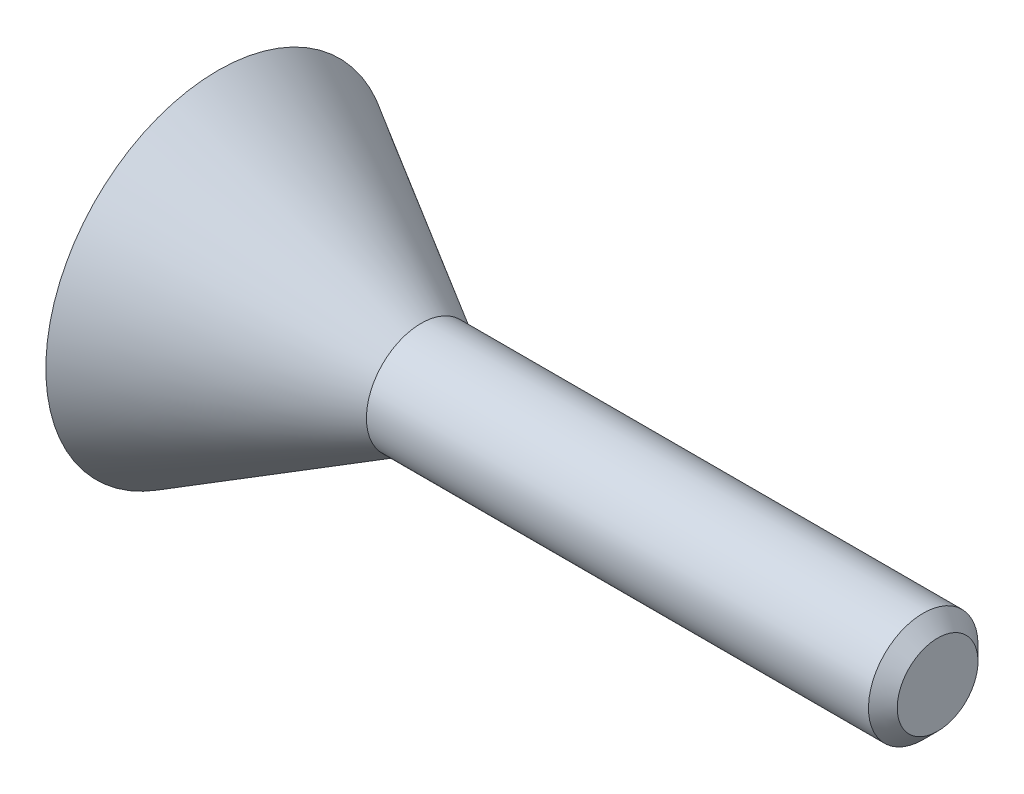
from build123d import *

# Parameters (mm, degrees)
SKETCH1_R           = 5.5
BOSS_EXTRUDE1_DEPTH = 11.5
CUT_EXTRUDE1_DEPTH  = 0.6
CHAMFER1_SIZE       = 0.46
CUT_EXTRUDE2_DEPTH  = 0.6


with BuildPart() as part:
    # Sketch1 → Boss-Extrude1 (new, symmetric)
    with BuildSketch(Plane(origin=(0, 0, 0), x_dir=(0, 0, -1), z_dir=(1, 0, 0))):
        Circle(SKETCH1_R)
    extrude(amount=BOSS_EXTRUDE1_DEPTH, both=True)

    # Sketch2 → Cut-Revolve1 (revolve, cut)
    with BuildSketch(Plane.XY, mode=Mode.PRIVATE) as cut_revolve1_sk:
        Polygon((-5.004809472, 1.75), (11.5, 1.75), (11.5, 5.5), (-11.5, 5.5), align=None)
    revolve(cut_revolve1_sk.sketch.rotate(Axis((-11.5, 0, 0), (1, 0, 0)), 180), axis=Axis((-11.5, 0, 0), (1, 0, 0)), mode=Mode.SUBTRACT)

    # Sketch3 → Cut-Extrude1 (cut)
    with BuildSketch(Plane.ZY.offset(11.5)):
        with BuildLine():
            Line((0.42, 3.15), (0.42, -4.07))
            ThreePointArc((0.42, -4.07), (0, -4.49), (-0.42, -4.07))
            Line((-0.42, -4.07), (-0.42, 3.15))
            Line((-0.42, 3.15), (-1.01, 3.15))
            Line((-1.01, 3.15), (0, 4.83))
            Line((0, 4.83), (1.01, 3.15))
            Line((1.01, 3.15), (0.42, 3.15))
        make_face()
    extrude(amount=-CUT_EXTRUDE1_DEPTH, mode=Mode.SUBTRACT)

    # Chamfer1
    chamfer1_edges = [part.edges().sort_by_distance(p)[0] for p in [
        (11.5, 1.75, 0),
    ]]
    chamfer(chamfer1_edges, length=CHAMFER1_SIZE)

    # Sketch4 → Cut-Extrude2 (cut)
    with BuildSketch(Plane.ZY.offset(11.5)):
        with BuildLine():
            Line((3.410725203, -1.922656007), (3.410725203, -1.242461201))
            Line((3.410725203, -1.242461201), (2.043842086, 0.568415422))
            add(Edge.make_bspline(
                [(2.043842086, 0.568415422), (2.015212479, 0.608756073), (1.959428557, 0.687358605), (1.90893981, 0.795303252), (1.877487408, 0.879933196), (1.862497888, 0.94130661), (1.85180483, 0.999862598), (1.850488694, 1.03833865), (1.84984858, 1.057051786)],
                knots=[0, 0, 0, 0, 1.664252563, 3.24274559, 3.998498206, 4.704056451, 5.369707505, 6, 6, 6, 6], degree=3))
            Line((1.84984858, 1.057051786), (1.84984858, 1.062733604))
            add(Edge.make_bspline(
                [(1.84984858, 1.062733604), (1.850957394, 1.088309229), (1.853081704, 1.137308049), (1.873096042, 1.206348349), (1.905898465, 1.266471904), (1.952879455, 1.316133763), (2.011367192, 1.355413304), (2.081349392, 1.383095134), (2.161910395, 1.398968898), (2.219092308, 1.400967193), (2.249199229, 1.402019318)],
                knots=[0, 0, 0, 0, 1.029992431, 1.973301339, 2.872554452, 3.768620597, 4.704316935, 5.693697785, 6.785705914, 8, 8, 8, 8], degree=3))
            add(Edge.make_bspline(
                [(2.249199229, 1.402019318), (2.278605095, 1.400871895), (2.335741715, 1.398642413), (2.416628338, 1.373933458), (2.489515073, 1.335175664), (2.552349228, 1.279873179), (2.604380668, 1.210438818), (2.646609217, 1.128674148), (2.675290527, 1.033102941), (2.685436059, 0.964689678), (2.690757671, 0.928805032)],
                knots=[0, 0, 0, 0, 0.980828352, 1.905783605, 2.800718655, 3.724477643, 4.680224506, 5.688112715, 6.78735127, 8, 8, 8, 8], degree=3))
            Line((2.690757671, 0.928805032), (2.690757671, 0.926369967))
            Line((2.690757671, 0.926369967), (3.46023819, 0.926369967))
            Line((3.46023819, 0.926369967), (3.46023819, 0.928805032))
            add(Edge.make_bspline(
                [(3.46023819, 0.928805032), (3.456441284, 0.97517066), (3.449029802, 1.06567541), (3.424731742, 1.196594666), (3.393327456, 1.319911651), (3.353376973, 1.43560188), (3.30204046, 1.542325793), (3.244362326, 1.642314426), (3.174989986, 1.73247518), (3.099052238, 1.815825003), (3.014471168, 1.889238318), (2.924284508, 1.953998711), (2.827128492, 2.007889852), (2.724480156, 2.052595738), (2.615201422, 2.086526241), (2.500719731, 2.111942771), (2.379721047, 2.126600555), (2.297128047, 2.12838122), (2.254881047, 2.129292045)],
                knots=[0, 0, 0, 0, 1.173229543, 2.290119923, 3.354877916, 4.382703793, 5.372196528, 6.339367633, 7.289741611, 8.236749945, 9.180232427, 10.11040526, 11.033485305, 11.978374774, 12.930610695, 13.916256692, 14.93414813, 16, 16, 16, 16], degree=3))
            add(Edge.make_bspline(
                [(2.254881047, 2.129292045), (2.209389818, 2.128645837), (2.120915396, 2.127389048), (1.992111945, 2.113822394), (1.870921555, 2.093346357), (1.757539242, 2.063390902), (1.652420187, 2.024316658), (1.555249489, 1.977202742), (1.465824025, 1.921647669), (1.38482865, 1.857532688), (1.311952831, 1.786022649), (1.249226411, 1.70639174), (1.194926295, 1.620249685), (1.152480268, 1.52592568), (1.117535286, 1.425637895), (1.094908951, 1.317588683), (1.079661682, 1.203050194), (1.077981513, 1.124204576), (1.077121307, 1.0838375)],
                knots=[0, 0, 0, 0, 1.219700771, 2.37215663, 3.469774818, 4.513610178, 5.512457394, 6.473141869, 7.405450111, 8.330272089, 9.238546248, 10.1372905, 11.043445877, 11.962355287, 12.905558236, 13.886315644, 14.917844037, 16, 16, 16, 16], degree=3))
            Line((1.077121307, 1.0838375), (1.077121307, 1.080590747))
            add(Edge.make_bspline(
                [(1.077121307, 1.080590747), (1.078156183, 1.035078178), (1.080227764, 0.943972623), (1.098927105, 0.807620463), (1.12906073, 0.671964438), (1.170444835, 0.537659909), (1.221854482, 0.407033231), (1.283555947, 0.281873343), (1.353193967, 0.162124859), (1.408375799, 0.08821757), (1.435887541, 0.051369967)],
                knots=[0, 0, 0, 0, 0.984368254, 1.970475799, 2.971844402, 3.988480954, 5.008197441, 6.005725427, 7.005724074, 8, 8, 8, 8], degree=3))
            Line((1.435887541, 0.051369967), (2.416407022, -1.195383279))
            Line((2.416407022, -1.195383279), (1.055205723, -1.195383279))
            Line((1.055205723, -1.195383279), (1.055205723, -1.922656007))
            Line((1.055205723, -1.922656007), (3.410725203, -1.922656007))
        make_face()
        Polygon((-3.311839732, 2.077343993), (-3.311839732, 1.575720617), (-2.418982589, -1.922656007), (-1.605670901, -1.922656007), (-2.470930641, 1.350071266), (-1.786677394, 1.350071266), (-1.786677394, 0.726694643), (-1.035865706, 0.726694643), (-1.035865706, 2.077343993), align=None)
    extrude(amount=-CUT_EXTRUDE2_DEPTH, mode=Mode.SUBTRACT)


solid = part.part
